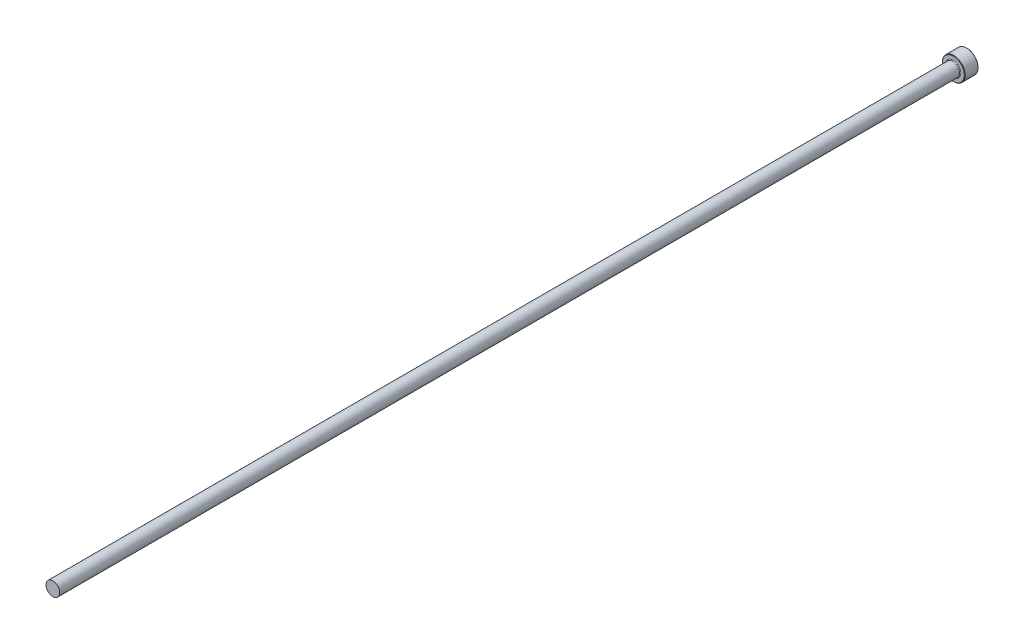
ISO-10303-21;
HEADER;
FILE_DESCRIPTION(('STEP AP214'),'2;1');
FILE_NAME('part.step','',(''),(''),'','','');
FILE_SCHEMA(('AUTOMOTIVE_DESIGN { 1 0 10303 214 1 1 1 1 }'));
ENDSEC;
DATA;
#1=APPLICATION_CONTEXT('core data for automotive mechanical design processes');
#2=APPLICATION_PROTOCOL_DEFINITION('international standard','automotive_design',2000,#1);
#3=PRODUCT_CONTEXT('',#1,'mechanical');
#4=PRODUCT('Part','Part','',(#3));
#5=PRODUCT_RELATED_PRODUCT_CATEGORY('part','',(#4));
#6=PRODUCT_DEFINITION_FORMATION('','',#4);
#7=PRODUCT_DEFINITION_CONTEXT('part definition',#1,'design');
#8=PRODUCT_DEFINITION('design','',#6,#7);
#9=PRODUCT_DEFINITION_SHAPE('','',#8);
#10=(LENGTH_UNIT() NAMED_UNIT(*) SI_UNIT(.MILLI.,.METRE.));
#11=(NAMED_UNIT(*) PLANE_ANGLE_UNIT() SI_UNIT($,.RADIAN.));
#12=(NAMED_UNIT(*) SI_UNIT($,.STERADIAN.) SOLID_ANGLE_UNIT());
#13=UNCERTAINTY_MEASURE_WITH_UNIT(LENGTH_MEASURE(1.E-05),#10,'distance_accuracy_value','');
#14=(GEOMETRIC_REPRESENTATION_CONTEXT(3) GLOBAL_UNCERTAINTY_ASSIGNED_CONTEXT((#13)) GLOBAL_UNIT_ASSIGNED_CONTEXT((#10,
#11,#12)) REPRESENTATION_CONTEXT('',''));
#15=CARTESIAN_POINT('',(0.,0.,0.));
#16=DIRECTION('',(0.,0.,1.));
#17=DIRECTION('',(1.,0.,0.));
#18=AXIS2_PLACEMENT_3D('',#15,#16,#17);
#19=CARTESIAN_POINT('',(0.,2.99999999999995,400.));
#20=DIRECTION('',(0.,0.,-1.));
#21=DIRECTION('',(-1.,0.,0.));
#22=AXIS2_PLACEMENT_3D('',#19,#20,#21);
#23=PLANE('',#22);
#24=CARTESIAN_POINT('',(0.,0.,400.));
#25=DIRECTION('',(0.,0.,1.));
#26=DIRECTION('',(1.,0.,0.));
#27=AXIS2_PLACEMENT_3D('',#24,#25,#26);
#28=CIRCLE('',#27,2.99999999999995);
#29=CARTESIAN_POINT('',(2.99999999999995,0.,400.));
#30=VERTEX_POINT('',#29);
#31=EDGE_CURVE('E50',#30,#30,#28,.T.);
#32=ORIENTED_EDGE('',*,*,#31,.T.);
#33=EDGE_LOOP('',(#32));
#34=FACE_BOUND('',#33,.T.);
#35=ADVANCED_FACE('F30',(#34),#23,.F.);
#36=CARTESIAN_POINT('',(0.,0.,109.050628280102));
#37=DIRECTION('',(0.,0.,1.));
#38=DIRECTION('',(1.,0.,0.));
#39=AXIS2_PLACEMENT_3D('',#36,#37,#38);
#40=CYLINDRICAL_SURFACE('',#39,2.99999999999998);
#41=ORIENTED_EDGE('',*,*,#31,.F.);
#42=EDGE_LOOP('',(#41));
#43=FACE_BOUND('',#42,.T.);
#44=CARTESIAN_POINT('',(0.,0.,6.3));
#45=DIRECTION('',(0.,0.,1.));
#46=DIRECTION('',(1.,0.,0.));
#47=AXIS2_PLACEMENT_3D('',#44,#45,#46);
#48=CIRCLE('',#47,3.);
#49=CARTESIAN_POINT('',(3.,0.,6.3));
#50=VERTEX_POINT('',#49);
#51=EDGE_CURVE('E53',#50,#50,#48,.T.);
#52=ORIENTED_EDGE('',*,*,#51,.T.);
#53=EDGE_LOOP('',(#52));
#54=FACE_BOUND('',#53,.T.);
#55=ADVANCED_FACE('F73',(#43,#54),#40,.T.);
#56=CARTESIAN_POINT('',(0.,0.,6.3));
#57=DIRECTION('',(0.,0.,1.));
#58=DIRECTION('',(1.,0.,0.));
#59=AXIS2_PLACEMENT_3D('',#56,#57,#58);
#60=TOROIDAL_SURFACE('',#59,3.3,0.3);
#61=ORIENTED_EDGE('',*,*,#51,.F.);
#62=EDGE_LOOP('',(#61));
#63=FACE_BOUND('',#62,.T.);
#64=CARTESIAN_POINT('',(0.,0.,6.00000000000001));
#65=DIRECTION('',(0.,0.,1.));
#66=DIRECTION('',(1.,0.,0.));
#67=AXIS2_PLACEMENT_3D('',#64,#65,#66);
#68=CIRCLE('',#67,3.3);
#69=CARTESIAN_POINT('',(3.3,0.,6.00000000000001));
#70=VERTEX_POINT('',#69);
#71=EDGE_CURVE('E56',#70,#70,#68,.T.);
#72=ORIENTED_EDGE('',*,*,#71,.T.);
#73=EDGE_LOOP('',(#72));
#74=FACE_BOUND('',#73,.T.);
#75=ADVANCED_FACE('F60',(#63,#74),#60,.F.);
#76=CARTESIAN_POINT('',(0.,5.,6.));
#77=DIRECTION('',(0.,0.,-1.));
#78=DIRECTION('',(-1.,0.,0.));
#79=AXIS2_PLACEMENT_3D('',#76,#77,#78);
#80=PLANE('',#79);
#81=CARTESIAN_POINT('',(0.,0.,6.));
#82=DIRECTION('',(0.,0.,-1.));
#83=DIRECTION('',(-1.,0.,0.));
#84=AXIS2_PLACEMENT_3D('',#81,#82,#83);
#85=CIRCLE('',#84,4.80000000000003);
#86=CARTESIAN_POINT('',(-4.80000000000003,0.,6.));
#87=VERTEX_POINT('',#86);
#88=EDGE_CURVE('E10',#87,#87,#85,.F.);
#89=ORIENTED_EDGE('',*,*,#88,.T.);
#90=EDGE_LOOP('',(#89));
#91=FACE_BOUND('',#90,.T.);
#92=ORIENTED_EDGE('',*,*,#71,.F.);
#93=EDGE_LOOP('',(#92));
#94=FACE_BOUND('',#93,.T.);
#95=ADVANCED_FACE('F62',(#91,#94),#80,.F.);
#96=CARTESIAN_POINT('',(0.,0.,109.050628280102));
#97=DIRECTION('',(0.,0.,1.));
#98=DIRECTION('',(1.,0.,0.));
#99=AXIS2_PLACEMENT_3D('',#96,#97,#98);
#100=CYLINDRICAL_SURFACE('',#99,5.);
#101=CARTESIAN_POINT('',(0.,0.,0.200000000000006));
#102=DIRECTION('',(0.,0.,1.));
#103=DIRECTION('',(1.,0.,0.));
#104=AXIS2_PLACEMENT_3D('',#101,#102,#103);
#105=CIRCLE('',#104,5.);
#106=CARTESIAN_POINT('',(5.,0.,0.200000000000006));
#107=VERTEX_POINT('',#106);
#108=EDGE_CURVE('E41',#107,#107,#105,.T.);
#109=ORIENTED_EDGE('',*,*,#108,.T.);
#110=EDGE_LOOP('',(#109));
#111=FACE_BOUND('',#110,.T.);
#112=CARTESIAN_POINT('',(0.,0.,5.8));
#113=DIRECTION('',(0.,0.,-1.));
#114=DIRECTION('',(-1.,0.,0.));
#115=AXIS2_PLACEMENT_3D('',#112,#113,#114);
#116=CIRCLE('',#115,5.);
#117=CARTESIAN_POINT('',(-5.,0.,5.8));
#118=VERTEX_POINT('',#117);
#119=EDGE_CURVE('E45',#118,#118,#116,.T.);
#120=ORIENTED_EDGE('',*,*,#119,.T.);
#121=EDGE_LOOP('',(#120));
#122=FACE_BOUND('',#121,.T.);
#123=ADVANCED_FACE('F64',(#111,#122),#100,.T.);
#124=CARTESIAN_POINT('',(0.,0.,0.));
#125=DIRECTION('',(0.,0.,1.));
#126=DIRECTION('',(1.,0.,0.));
#127=AXIS2_PLACEMENT_3D('',#124,#125,#126);
#128=PLANE('',#127);
#129=CARTESIAN_POINT('',(0.,0.,0.));
#130=DIRECTION('',(0.,0.,1.));
#131=DIRECTION('',(1.,0.,0.));
#132=AXIS2_PLACEMENT_3D('',#129,#130,#131);
#133=CIRCLE('',#132,4.79999999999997);
#134=CARTESIAN_POINT('',(4.79999999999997,0.,0.));
#135=VERTEX_POINT('',#134);
#136=EDGE_CURVE('E37',#135,#135,#133,.F.);
#137=ORIENTED_EDGE('',*,*,#136,.T.);
#138=EDGE_LOOP('',(#137));
#139=FACE_BOUND('',#138,.T.);
#140=ADVANCED_FACE('F70',(#139),#128,.F.);
#141=CARTESIAN_POINT('',(0.,0.,0.200000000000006));
#142=DIRECTION('',(0.,0.,1.));
#143=DIRECTION('',(1.,0.,0.));
#144=AXIS2_PLACEMENT_3D('',#141,#142,#143);
#145=CONICAL_SURFACE('',#144,5.,0.785398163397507);
#146=ORIENTED_EDGE('',*,*,#136,.F.);
#147=EDGE_LOOP('',(#146));
#148=FACE_BOUND('',#147,.T.);
#149=ORIENTED_EDGE('',*,*,#108,.F.);
#150=EDGE_LOOP('',(#149));
#151=FACE_BOUND('',#150,.T.);
#152=ADVANCED_FACE('F84',(#148,#151),#145,.T.);
#153=CARTESIAN_POINT('',(0.,0.,6.00000000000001));
#154=DIRECTION('',(0.,0.,-1.));
#155=DIRECTION('',(-1.,0.,0.));
#156=AXIS2_PLACEMENT_3D('',#153,#154,#155);
#157=CONICAL_SURFACE('',#156,4.80000000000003,0.785398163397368);
#158=ORIENTED_EDGE('',*,*,#119,.F.);
#159=EDGE_LOOP('',(#158));
#160=FACE_BOUND('',#159,.T.);
#161=ORIENTED_EDGE('',*,*,#88,.F.);
#162=EDGE_LOOP('',(#161));
#163=FACE_BOUND('',#162,.T.);
#164=ADVANCED_FACE('F32',(#160,#163),#157,.T.);
#165=CLOSED_SHELL('',(#35,#55,#75,#95,#123,#140,#152,#164));
#166=MANIFOLD_SOLID_BREP('B2',#165);
#167=ADVANCED_BREP_SHAPE_REPRESENTATION('',(#18,#166),#14);
#168=SHAPE_DEFINITION_REPRESENTATION(#9,#167);
ENDSEC;
END-ISO-10303-21;
